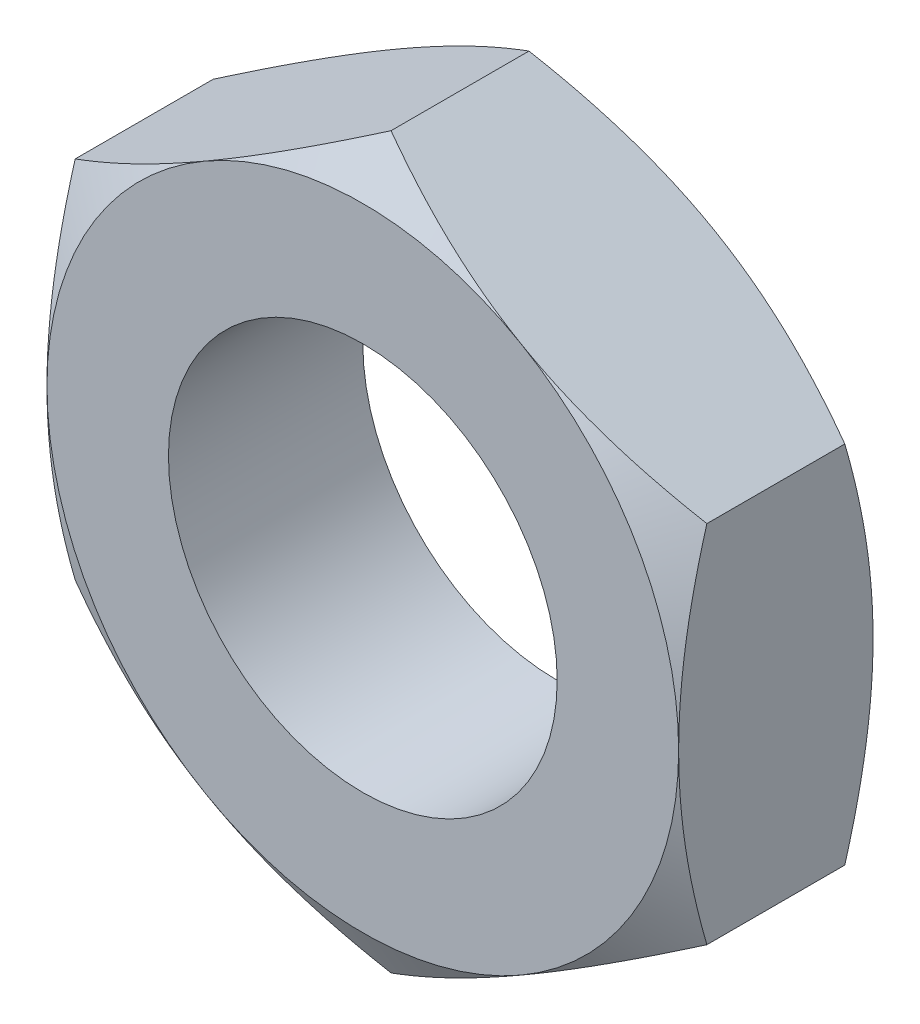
ISO-10303-21;
HEADER;
FILE_DESCRIPTION(('STEP AP214'),'2;1');
FILE_NAME('part.step','',(''),(''),'','','');
FILE_SCHEMA(('AUTOMOTIVE_DESIGN { 1 0 10303 214 1 1 1 1 }'));
ENDSEC;
DATA;
#1=APPLICATION_CONTEXT('core data for automotive mechanical design processes');
#2=APPLICATION_PROTOCOL_DEFINITION('international standard','automotive_design',2000,#1);
#3=PRODUCT_CONTEXT('',#1,'mechanical');
#4=PRODUCT('Part','Part','',(#3));
#5=PRODUCT_RELATED_PRODUCT_CATEGORY('part','',(#4));
#6=PRODUCT_DEFINITION_FORMATION('','',#4);
#7=PRODUCT_DEFINITION_CONTEXT('part definition',#1,'design');
#8=PRODUCT_DEFINITION('design','',#6,#7);
#9=PRODUCT_DEFINITION_SHAPE('','',#8);
#10=(LENGTH_UNIT() NAMED_UNIT(*) SI_UNIT(.MILLI.,.METRE.));
#11=(NAMED_UNIT(*) PLANE_ANGLE_UNIT() SI_UNIT($,.RADIAN.));
#12=(NAMED_UNIT(*) SI_UNIT($,.STERADIAN.) SOLID_ANGLE_UNIT());
#13=UNCERTAINTY_MEASURE_WITH_UNIT(LENGTH_MEASURE(1.E-05),#10,'distance_accuracy_value','');
#14=(GEOMETRIC_REPRESENTATION_CONTEXT(3) GLOBAL_UNCERTAINTY_ASSIGNED_CONTEXT((#13)) GLOBAL_UNIT_ASSIGNED_CONTEXT((#10,
#11,#12)) REPRESENTATION_CONTEXT('',''));
#15=CARTESIAN_POINT('',(0.,0.,0.));
#16=DIRECTION('',(0.,0.,1.));
#17=DIRECTION('',(1.,0.,0.));
#18=AXIS2_PLACEMENT_3D('',#15,#16,#17);
#19=CARTESIAN_POINT('',(4.,0.,0.));
#20=DIRECTION('',(0.,0.,-1.));
#21=DIRECTION('',(0.,1.,0.));
#22=AXIS2_PLACEMENT_3D('',#19,#20,#21);
#23=PLANE('',#22);
#24=CARTESIAN_POINT('',(0.,0.,0.));
#25=DIRECTION('',(0.,0.,-1.));
#26=DIRECTION('',(0.,1.,0.));
#27=AXIS2_PLACEMENT_3D('',#24,#25,#26);
#28=CIRCLE('',#27,4.);
#29=CARTESIAN_POINT('',(0.,4.,0.));
#30=VERTEX_POINT('',#29);
#31=EDGE_CURVE('E109',#30,#30,#28,.T.);
#32=ORIENTED_EDGE('',*,*,#31,.F.);
#33=EDGE_LOOP('',(#32));
#34=FACE_BOUND('',#33,.T.);
#35=CARTESIAN_POINT('',(0.,0.,1.59178226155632E-11));
#36=DIRECTION('',(0.,0.,1.));
#37=DIRECTION('',(0.,-1.,0.));
#38=AXIS2_PLACEMENT_3D('',#35,#36,#37);
#39=CIRCLE('',#38,6.49999999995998);
#40=CARTESIAN_POINT('',(-3.24999999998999,5.62916512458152,2.74710809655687E-11));
#41=VERTEX_POINT('',#40);
#42=CARTESIAN_POINT('',(-6.49999999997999,0.,2.74710809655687E-11));
#43=VERTEX_POINT('',#42);
#44=EDGE_CURVE('E415',#41,#43,#39,.T.);
#45=ORIENTED_EDGE('',*,*,#44,.F.);
#46=CARTESIAN_POINT('',(0.,0.,1.59178226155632E-11));
#47=DIRECTION('',(0.,0.,1.));
#48=DIRECTION('',(0.,-1.,0.));
#49=AXIS2_PLACEMENT_3D('',#46,#47,#48);
#50=CIRCLE('',#49,6.49999999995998);
#51=CARTESIAN_POINT('',(3.24999999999,5.62916512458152,2.74710809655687E-11));
#52=VERTEX_POINT('',#51);
#53=EDGE_CURVE('E104',#52,#41,#50,.T.);
#54=ORIENTED_EDGE('',*,*,#53,.F.);
#55=CARTESIAN_POINT('',(0.,0.,1.59178226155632E-11));
#56=DIRECTION('',(0.,0.,1.));
#57=DIRECTION('',(0.,-1.,0.));
#58=AXIS2_PLACEMENT_3D('',#55,#56,#57);
#59=CIRCLE('',#58,6.49999999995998);
#60=CARTESIAN_POINT('',(6.49999999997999,0.,2.74710809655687E-11));
#61=VERTEX_POINT('',#60);
#62=EDGE_CURVE('E17',#61,#52,#59,.T.);
#63=ORIENTED_EDGE('',*,*,#62,.F.);
#64=CARTESIAN_POINT('',(0.,0.,1.59178226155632E-11));
#65=DIRECTION('',(0.,0.,1.));
#66=DIRECTION('',(0.,-1.,0.));
#67=AXIS2_PLACEMENT_3D('',#64,#65,#66);
#68=CIRCLE('',#67,6.49999999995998);
#69=CARTESIAN_POINT('',(3.24999999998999,-5.62916512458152,2.74710809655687E-11));
#70=VERTEX_POINT('',#69);
#71=EDGE_CURVE('E101',#70,#61,#68,.T.);
#72=ORIENTED_EDGE('',*,*,#71,.F.);
#73=CARTESIAN_POINT('',(0.,0.,1.59178226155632E-11));
#74=DIRECTION('',(0.,0.,1.));
#75=DIRECTION('',(0.,-1.,0.));
#76=AXIS2_PLACEMENT_3D('',#73,#74,#75);
#77=CIRCLE('',#76,6.49999999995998);
#78=CARTESIAN_POINT('',(-3.24999999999,-5.62916512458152,2.74710809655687E-11));
#79=VERTEX_POINT('',#78);
#80=EDGE_CURVE('E119',#79,#70,#77,.T.);
#81=ORIENTED_EDGE('',*,*,#80,.F.);
#82=CARTESIAN_POINT('',(0.,0.,1.59178226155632E-11));
#83=DIRECTION('',(0.,0.,1.));
#84=DIRECTION('',(0.,-1.,0.));
#85=AXIS2_PLACEMENT_3D('',#82,#83,#84);
#86=CIRCLE('',#85,6.49999999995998);
#87=EDGE_CURVE('E417',#43,#79,#86,.T.);
#88=ORIENTED_EDGE('',*,*,#87,.F.);
#89=EDGE_LOOP('',(#45,#54,#63,#72,#81,#88));
#90=FACE_BOUND('',#89,.T.);
#91=ADVANCED_FACE('F14',(#34,#90),#23,.T.);
#92=CARTESIAN_POINT('',(0.,0.,0.584039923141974));
#93=DIRECTION('',(0.,0.,1.));
#94=DIRECTION('',(0.,-1.,0.));
#95=AXIS2_PLACEMENT_3D('',#92,#93,#94);
#96=CONICAL_SURFACE('',#95,7.51158682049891,1.047197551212);
#97=CARTESIAN_POINT('',(6.49999999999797,3.75277674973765,0.580556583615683));
#98=CARTESIAN_POINT('',(6.2354513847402,3.90551396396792,0.492351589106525));
#99=CARTESIAN_POINT('',(5.96878416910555,4.05947435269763,0.411540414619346));
#100=CARTESIAN_POINT('',(5.43309909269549,4.36875227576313,0.26903136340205));
#101=CARTESIAN_POINT('',(5.16409991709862,4.52405902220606,0.207238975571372));
#102=CARTESIAN_POINT('',(4.75806245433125,4.75848486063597,0.131368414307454));
#103=CARTESIAN_POINT('',(4.622203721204,4.83692293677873,0.108872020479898));
#104=CARTESIAN_POINT('',(4.34983584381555,4.99417460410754,0.0699302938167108));
#105=CARTESIAN_POINT('',(4.21332671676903,5.07298818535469,0.0534848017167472));
#106=CARTESIAN_POINT('',(3.9391531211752,5.23128238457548,0.0269338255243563));
#107=CARTESIAN_POINT('',(3.80148629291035,5.31076436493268,0.0168605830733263));
#108=CARTESIAN_POINT('',(3.52588189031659,5.46988464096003,0.00337972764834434));
#109=CARTESIAN_POINT('',(3.38794426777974,5.54952296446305,-2.65652187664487E-05));
#110=CARTESIAN_POINT('',(3.24999999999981,5.62916512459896,3.90243393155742E-11));
#111=B_SPLINE_CURVE_WITH_KNOTS('',3,(#97,#98,#99,#100,#101,#102,#103,#104,#105,#106,#107,#108,
#109,#110),.UNSPECIFIED.,.F.,.F.,(4,2,2,2,2,2,4),(0.,0.954247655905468,1.90367376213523,
2.37900973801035,2.85433320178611,3.33204281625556,3.80984701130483),.UNSPECIFIED.);
#112=CARTESIAN_POINT('',(6.49999999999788,3.75277674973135,0.580556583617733));
#113=VERTEX_POINT('',#112);
#114=EDGE_CURVE('E124',#113,#52,#111,.T.);
#115=ORIENTED_EDGE('',*,*,#114,.F.);
#116=CARTESIAN_POINT('',(6.50000000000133,0.,3.82541220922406E-11));
#117=CARTESIAN_POINT('',(6.50000000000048,0.159284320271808,-2.65652190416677E-05));
#118=CARTESIAN_POINT('',(6.50000000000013,0.318560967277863,0.00337972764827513));
#119=CARTESIAN_POINT('',(6.49999999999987,0.636801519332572,0.0168605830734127));
#120=CARTESIAN_POINT('',(6.49999999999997,0.795765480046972,0.0269338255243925));
#121=CARTESIAN_POINT('',(6.50000000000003,1.11235387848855,0.0534848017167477));
#122=CARTESIAN_POINT('',(6.50000000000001,1.26998104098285,0.0699302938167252));
#123=CARTESIAN_POINT('',(6.49999999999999,1.58448437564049,0.108872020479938));
#124=CARTESIAN_POINT('',(6.5,1.74136052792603,0.131368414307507));
#125=CARTESIAN_POINT('',(6.50000000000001,2.21021220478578,0.207238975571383));
#126=CARTESIAN_POINT('',(6.5,2.52082569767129,0.269031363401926));
#127=CARTESIAN_POINT('',(6.5,3.13938154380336,0.411540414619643));
#128=CARTESIAN_POINT('',(6.49999999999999,3.44730232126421,0.492351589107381));
#129=CARTESIAN_POINT('',(6.5,3.75277674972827,0.580556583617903));
#130=B_SPLINE_CURVE_WITH_KNOTS('',3,(#116,#117,#118,#119,#120,#121,#122,#123,#124,#125,#126,
#127,#128,#129),.UNSPECIFIED.,.F.,.F.,(4,2,2,2,2,2,4),(0.,0.477804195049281,0.955513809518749,
1.43083727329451,1.90617324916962,2.85559935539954,3.80984701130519),.UNSPECIFIED.);
#131=EDGE_CURVE('E121',#61,#113,#130,.T.);
#132=ORIENTED_EDGE('',*,*,#131,.F.);
#133=ORIENTED_EDGE('',*,*,#62,.T.);
#134=EDGE_LOOP('',(#115,#132,#133));
#135=FACE_BOUND('',#134,.T.);
#136=ADVANCED_FACE('F122',(#135),#96,.T.);
#137=CARTESIAN_POINT('',(0.,0.,0.584039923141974));
#138=DIRECTION('',(0.,0.,1.));
#139=DIRECTION('',(0.,-1.,0.));
#140=AXIS2_PLACEMENT_3D('',#137,#138,#139);
#141=CONICAL_SURFACE('',#140,7.51158682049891,1.047197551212);
#142=CARTESIAN_POINT('',(-5.41299321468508E-12,7.50555349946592,0.580556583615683));
#143=CARTESIAN_POINT('',(-0.264548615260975,7.35281628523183,0.492351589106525));
#144=CARTESIAN_POINT('',(-0.531215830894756,7.19885589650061,0.411540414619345));
#145=CARTESIAN_POINT('',(-1.06690090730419,6.88957797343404,0.269031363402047));
#146=CARTESIAN_POINT('',(-1.33590008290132,6.73427122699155,0.207238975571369));
#147=CARTESIAN_POINT('',(-1.74193754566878,6.49984538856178,0.131368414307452));
#148=CARTESIAN_POINT('',(-1.87779627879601,6.42140731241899,0.108872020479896));
#149=CARTESIAN_POINT('',(-2.15016415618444,6.26415564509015,0.069930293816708));
#150=CARTESIAN_POINT('',(-2.28667328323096,6.18534206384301,0.0534848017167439));
#151=CARTESIAN_POINT('',(-2.5608468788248,6.02704786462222,0.0269338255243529));
#152=CARTESIAN_POINT('',(-2.69851370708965,5.94756588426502,0.0168605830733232));
#153=CARTESIAN_POINT('',(-2.97411810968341,5.78844560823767,0.00337972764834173));
#154=CARTESIAN_POINT('',(-3.11205573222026,5.70880728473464,-2.65652187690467E-05));
#155=CARTESIAN_POINT('',(-3.25000000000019,5.62916512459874,3.90208698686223E-11));
#156=B_SPLINE_CURVE_WITH_KNOTS('',3,(#142,#143,#144,#145,#146,#147,#148,#149,#150,#151,#152,
#153,#154,#155),.UNSPECIFIED.,.F.,.F.,(4,2,2,2,2,2,4),(0.,0.954247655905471,1.90367376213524,
2.37900973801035,2.85433320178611,3.33204281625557,3.80984701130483),.UNSPECIFIED.);
#157=CARTESIAN_POINT('',(0.,7.50555349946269,0.580556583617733));
#158=VERTEX_POINT('',#157);
#159=EDGE_CURVE('E294',#158,#41,#156,.T.);
#160=ORIENTED_EDGE('',*,*,#159,.F.);
#161=CARTESIAN_POINT('',(3.25000000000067,5.62916512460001,3.82541220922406E-11));
#162=CARTESIAN_POINT('',(3.11205573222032,5.70880728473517,-2.65652190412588E-05));
#163=CARTESIAN_POINT('',(2.97411810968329,5.7884456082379,0.00337972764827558));
#164=CARTESIAN_POINT('',(2.6985137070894,5.94756588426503,0.016860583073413));
#165=CARTESIAN_POINT('',(2.56084687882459,6.02704786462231,0.0269338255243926));
#166=CARTESIAN_POINT('',(2.28667328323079,6.18534206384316,0.0534848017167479));
#167=CARTESIAN_POINT('',(2.15016415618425,6.26415564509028,0.0699302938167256));
#168=CARTESIAN_POINT('',(1.87779627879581,6.42140731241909,0.108872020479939));
#169=CARTESIAN_POINT('',(1.74193754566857,6.49984538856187,0.131368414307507));
#170=CARTESIAN_POINT('',(1.33590008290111,6.73427122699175,0.207238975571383));
#171=CARTESIAN_POINT('',(1.06690090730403,6.8895779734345,0.269031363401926));
#172=CARTESIAN_POINT('',(0.531215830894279,7.19885589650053,0.411540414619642));
#173=CARTESIAN_POINT('',(0.26454861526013,7.35281628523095,0.49235158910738));
#174=CARTESIAN_POINT('',(3.72325430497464E-12,7.50555349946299,0.580556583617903));
#175=B_SPLINE_CURVE_WITH_KNOTS('',3,(#161,#162,#163,#164,#165,#166,#167,#168,#169,#170,#171,
#172,#173,#174),.UNSPECIFIED.,.F.,.F.,(4,2,2,2,2,2,4),(0.,0.477804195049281,0.955513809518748,
1.43083727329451,1.90617324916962,2.85559935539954,3.80984701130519),.UNSPECIFIED.);
#176=EDGE_CURVE('E302',#52,#158,#175,.T.);
#177=ORIENTED_EDGE('',*,*,#176,.F.);
#178=ORIENTED_EDGE('',*,*,#53,.T.);
#179=EDGE_LOOP('',(#160,#177,#178));
#180=FACE_BOUND('',#179,.T.);
#181=ADVANCED_FACE('F283',(#180),#141,.T.);
#182=CARTESIAN_POINT('',(0.,0.,0.584039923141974));
#183=DIRECTION('',(0.,0.,1.));
#184=DIRECTION('',(0.,-1.,0.));
#185=AXIS2_PLACEMENT_3D('',#182,#183,#184);
#186=CONICAL_SURFACE('',#185,7.51158682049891,1.047197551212);
#187=CARTESIAN_POINT('',(-6.50000000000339,3.75277674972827,0.580556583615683));
#188=CARTESIAN_POINT('',(-6.50000000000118,3.44730232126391,0.492351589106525));
#189=CARTESIAN_POINT('',(-6.50000000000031,3.13938154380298,0.411540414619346));
#190=CARTESIAN_POINT('',(-6.49999999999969,2.52082569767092,0.269031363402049));
#191=CARTESIAN_POINT('',(-6.49999999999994,2.21021220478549,0.207238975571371));
#192=CARTESIAN_POINT('',(-6.50000000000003,1.74136052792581,0.131368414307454));
#193=CARTESIAN_POINT('',(-6.50000000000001,1.58448437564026,0.108872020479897));
#194=CARTESIAN_POINT('',(-6.49999999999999,1.26998104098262,0.0699302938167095));
#195=CARTESIAN_POINT('',(-6.5,1.11235387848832,0.053484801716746));
#196=CARTESIAN_POINT('',(-6.5,0.795765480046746,0.0269338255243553));
#197=CARTESIAN_POINT('',(-6.5,0.636801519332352,0.0168605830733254));
#198=CARTESIAN_POINT('',(-6.5,0.318560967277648,0.003379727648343));
#199=CARTESIAN_POINT('',(-6.5,0.159284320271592,-2.65652187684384E-05));
#200=CARTESIAN_POINT('',(-6.5,-2.22069117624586E-13,3.90208698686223E-11));
#201=B_SPLINE_CURVE_WITH_KNOTS('',3,(#187,#188,#189,#190,#191,#192,#193,#194,#195,#196,#197,
#198,#199,#200),.UNSPECIFIED.,.F.,.F.,(4,2,2,2,2,2,4),(0.,0.954247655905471,1.90367376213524,
2.37900973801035,2.85433320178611,3.33204281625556,3.80984701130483),.UNSPECIFIED.);
#202=CARTESIAN_POINT('',(-6.49999999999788,3.75277674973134,0.580556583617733));
#203=VERTEX_POINT('',#202);
#204=EDGE_CURVE('E262',#203,#43,#201,.T.);
#205=ORIENTED_EDGE('',*,*,#204,.F.);
#206=CARTESIAN_POINT('',(-3.25000000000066,5.6291651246,3.82506526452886E-11));
#207=CARTESIAN_POINT('',(-3.38794426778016,5.54952296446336,-2.65652190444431E-05));
#208=CARTESIAN_POINT('',(-3.52588189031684,5.46988464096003,0.0033797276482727));
#209=CARTESIAN_POINT('',(-3.80148629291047,5.31076436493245,0.0168605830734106));
#210=CARTESIAN_POINT('',(-3.93915312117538,5.23128238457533,0.0269338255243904));
#211=CARTESIAN_POINT('',(-4.21332671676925,5.0729881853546,0.0534848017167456));
#212=CARTESIAN_POINT('',(-4.34983584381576,4.99417460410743,0.0699302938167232));
#213=CARTESIAN_POINT('',(-4.62220372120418,4.8369229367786,0.108872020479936));
#214=CARTESIAN_POINT('',(-4.75806245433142,4.75848486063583,0.131368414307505));
#215=CARTESIAN_POINT('',(-5.1640999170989,4.52405902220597,0.207238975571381));
#216=CARTESIAN_POINT('',(-5.43309909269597,4.36875227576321,0.269031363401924));
#217=CARTESIAN_POINT('',(-5.96878416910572,4.05947435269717,0.411540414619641));
#218=CARTESIAN_POINT('',(-6.23545138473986,3.90551396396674,0.492351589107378));
#219=CARTESIAN_POINT('',(-6.49999999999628,3.75277674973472,0.5805565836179));
#220=B_SPLINE_CURVE_WITH_KNOTS('',3,(#206,#207,#208,#209,#210,#211,#212,#213,#214,#215,#216,
#217,#218,#219),.UNSPECIFIED.,.F.,.F.,(4,2,2,2,2,2,4),(0.,0.477804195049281,0.955513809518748,
1.43083727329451,1.90617324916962,2.85559935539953,3.80984701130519),.UNSPECIFIED.);
#221=EDGE_CURVE('E287',#41,#203,#220,.T.);
#222=ORIENTED_EDGE('',*,*,#221,.F.);
#223=ORIENTED_EDGE('',*,*,#44,.T.);
#224=EDGE_LOOP('',(#205,#222,#223));
#225=FACE_BOUND('',#224,.T.);
#226=ADVANCED_FACE('F277',(#225),#186,.T.);
#227=CARTESIAN_POINT('',(0.,0.,0.584039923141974));
#228=DIRECTION('',(0.,0.,1.));
#229=DIRECTION('',(0.,-1.,0.));
#230=AXIS2_PLACEMENT_3D('',#227,#228,#229);
#231=CONICAL_SURFACE('',#230,7.51158682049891,1.047197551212);
#232=CARTESIAN_POINT('',(-6.50000000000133,0.,3.82541220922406E-11));
#233=CARTESIAN_POINT('',(-6.50000000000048,-0.159284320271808,-2.65652190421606E-05));
#234=CARTESIAN_POINT('',(-6.50000000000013,-0.318560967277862,0.00337972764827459));
#235=CARTESIAN_POINT('',(-6.49999999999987,-0.636801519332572,0.0168605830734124));
#236=CARTESIAN_POINT('',(-6.49999999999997,-0.795765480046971,0.0269338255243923));
#237=CARTESIAN_POINT('',(-6.50000000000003,-1.11235387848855,0.0534848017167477));
#238=CARTESIAN_POINT('',(-6.50000000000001,-1.26998104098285,0.0699302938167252));
#239=CARTESIAN_POINT('',(-6.49999999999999,-1.58448437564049,0.108872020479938));
#240=CARTESIAN_POINT('',(-6.5,-1.74136052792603,0.131368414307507));
#241=CARTESIAN_POINT('',(-6.50000000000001,-2.21021220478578,0.207238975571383));
#242=CARTESIAN_POINT('',(-6.5,-2.52082569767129,0.269031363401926));
#243=CARTESIAN_POINT('',(-6.5,-3.13938154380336,0.411540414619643));
#244=CARTESIAN_POINT('',(-6.49999999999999,-3.44730232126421,0.492351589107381));
#245=CARTESIAN_POINT('',(-6.5,-3.75277674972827,0.580556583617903));
#246=B_SPLINE_CURVE_WITH_KNOTS('',3,(#232,#233,#234,#235,#236,#237,#238,#239,#240,#241,#242,
#243,#244,#245),.UNSPECIFIED.,.F.,.F.,(4,2,2,2,2,2,4),(0.,0.477804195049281,0.955513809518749,
1.43083727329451,1.90617324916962,2.85559935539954,3.80984701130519),.UNSPECIFIED.);
#247=CARTESIAN_POINT('',(-6.49999999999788,-3.75277674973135,0.580556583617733));
#248=VERTEX_POINT('',#247);
#249=EDGE_CURVE('E255',#43,#248,#246,.T.);
#250=ORIENTED_EDGE('',*,*,#249,.F.);
#251=ORIENTED_EDGE('',*,*,#87,.T.);
#252=CARTESIAN_POINT('',(-6.49999999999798,-3.75277674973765,0.580556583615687));
#253=CARTESIAN_POINT('',(-6.23545138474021,-3.90551396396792,0.492351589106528));
#254=CARTESIAN_POINT('',(-5.96878416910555,-4.05947435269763,0.411540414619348));
#255=CARTESIAN_POINT('',(-5.4330990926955,-4.36875227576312,0.26903136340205));
#256=CARTESIAN_POINT('',(-5.16409991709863,-4.52405902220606,0.207238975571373));
#257=CARTESIAN_POINT('',(-4.75806245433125,-4.75848486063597,0.131368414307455));
#258=CARTESIAN_POINT('',(-4.622203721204,-4.83692293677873,0.108872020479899));
#259=CARTESIAN_POINT('',(-4.34983584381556,-4.99417460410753,0.0699302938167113));
#260=CARTESIAN_POINT('',(-4.21332671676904,-5.07298818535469,0.0534848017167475));
#261=CARTESIAN_POINT('',(-3.93915312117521,-5.23128238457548,0.0269338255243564));
#262=CARTESIAN_POINT('',(-3.80148629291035,-5.31076436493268,0.0168605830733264));
#263=CARTESIAN_POINT('',(-3.52588189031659,-5.46988464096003,0.00337972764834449));
#264=CARTESIAN_POINT('',(-3.38794426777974,-5.54952296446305,-2.65652187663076E-05));
#265=CARTESIAN_POINT('',(-3.24999999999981,-5.62916512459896,3.90243393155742E-11));
#266=B_SPLINE_CURVE_WITH_KNOTS('',3,(#252,#253,#254,#255,#256,#257,#258,#259,#260,#261,#262,
#263,#264,#265),.UNSPECIFIED.,.F.,.F.,(4,2,2,2,2,2,4),(0.,0.954247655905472,1.90367376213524,
2.37900973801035,2.85433320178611,3.33204281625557,3.80984701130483),.UNSPECIFIED.);
#267=EDGE_CURVE('E263',#248,#79,#266,.T.);
#268=ORIENTED_EDGE('',*,*,#267,.F.);
#269=EDGE_LOOP('',(#250,#251,#268));
#270=FACE_BOUND('',#269,.T.);
#271=ADVANCED_FACE('F274',(#270),#231,.T.);
#272=CARTESIAN_POINT('',(0.,0.,0.584039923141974));
#273=DIRECTION('',(0.,0.,1.));
#274=DIRECTION('',(0.,-1.,0.));
#275=AXIS2_PLACEMENT_3D('',#272,#273,#274);
#276=CONICAL_SURFACE('',#275,7.51158682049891,1.047197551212);
#277=CARTESIAN_POINT('',(5.41299321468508E-12,-7.50555349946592,0.580556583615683));
#278=CARTESIAN_POINT('',(0.264548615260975,-7.35281628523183,0.492351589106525));
#279=CARTESIAN_POINT('',(0.531215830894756,-7.19885589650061,0.411540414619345));
#280=CARTESIAN_POINT('',(1.06690090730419,-6.88957797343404,0.269031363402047));
#281=CARTESIAN_POINT('',(1.33590008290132,-6.73427122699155,0.207238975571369));
#282=CARTESIAN_POINT('',(1.74193754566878,-6.49984538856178,0.131368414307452));
#283=CARTESIAN_POINT('',(1.87779627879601,-6.42140731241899,0.108872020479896));
#284=CARTESIAN_POINT('',(2.15016415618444,-6.26415564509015,0.069930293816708));
#285=CARTESIAN_POINT('',(2.28667328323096,-6.18534206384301,0.0534848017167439));
#286=CARTESIAN_POINT('',(2.5608468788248,-6.02704786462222,0.0269338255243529));
#287=CARTESIAN_POINT('',(2.69851370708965,-5.94756588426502,0.0168605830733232));
#288=CARTESIAN_POINT('',(2.97411810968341,-5.78844560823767,0.00337972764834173));
#289=CARTESIAN_POINT('',(3.11205573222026,-5.70880728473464,-2.65652187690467E-05));
#290=CARTESIAN_POINT('',(3.25000000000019,-5.62916512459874,3.90208698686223E-11));
#291=B_SPLINE_CURVE_WITH_KNOTS('',3,(#277,#278,#279,#280,#281,#282,#283,#284,#285,#286,#287,
#288,#289,#290),.UNSPECIFIED.,.F.,.F.,(4,2,2,2,2,2,4),(0.,0.954247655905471,1.90367376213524,
2.37900973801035,2.85433320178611,3.33204281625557,3.80984701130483),.UNSPECIFIED.);
#292=CARTESIAN_POINT('',(0.,-7.50555349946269,0.580556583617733));
#293=VERTEX_POINT('',#292);
#294=EDGE_CURVE('E163',#293,#70,#291,.T.);
#295=ORIENTED_EDGE('',*,*,#294,.F.);
#296=CARTESIAN_POINT('',(-3.25000000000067,-5.62916512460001,3.82541220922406E-11));
#297=CARTESIAN_POINT('',(-3.11205573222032,-5.70880728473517,-2.65652190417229E-05));
#298=CARTESIAN_POINT('',(-2.97411810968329,-5.7884456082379,0.00337972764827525));
#299=CARTESIAN_POINT('',(-2.6985137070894,-5.94756588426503,0.0168605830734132));
#300=CARTESIAN_POINT('',(-2.56084687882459,-6.02704786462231,0.0269338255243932));
#301=CARTESIAN_POINT('',(-2.28667328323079,-6.18534206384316,0.0534848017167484));
#302=CARTESIAN_POINT('',(-2.15016415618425,-6.26415564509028,0.0699302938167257));
#303=CARTESIAN_POINT('',(-1.87779627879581,-6.42140731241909,0.108872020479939));
#304=CARTESIAN_POINT('',(-1.74193754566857,-6.49984538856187,0.131368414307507));
#305=CARTESIAN_POINT('',(-1.33590008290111,-6.73427122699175,0.207238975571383));
#306=CARTESIAN_POINT('',(-1.06690090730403,-6.8895779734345,0.269031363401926));
#307=CARTESIAN_POINT('',(-0.531215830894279,-7.19885589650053,0.411540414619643));
#308=CARTESIAN_POINT('',(-0.264548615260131,-7.35281628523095,0.49235158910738));
#309=CARTESIAN_POINT('',(-3.72387259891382E-12,-7.50555349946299,0.580556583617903));
#310=B_SPLINE_CURVE_WITH_KNOTS('',3,(#296,#297,#298,#299,#300,#301,#302,#303,#304,#305,#306,
#307,#308,#309),.UNSPECIFIED.,.F.,.F.,(4,2,2,2,2,2,4),(0.,0.47780419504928,0.955513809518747,
1.43083727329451,1.90617324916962,2.85559935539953,3.80984701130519),.UNSPECIFIED.);
#311=EDGE_CURVE('E368',#79,#293,#310,.T.);
#312=ORIENTED_EDGE('',*,*,#311,.F.);
#313=ORIENTED_EDGE('',*,*,#80,.T.);
#314=EDGE_LOOP('',(#295,#312,#313));
#315=FACE_BOUND('',#314,.T.);
#316=ADVANCED_FACE('F150',(#315),#276,.T.);
#317=CARTESIAN_POINT('',(0.,0.,0.584039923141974));
#318=DIRECTION('',(0.,0.,1.));
#319=DIRECTION('',(0.,-1.,0.));
#320=AXIS2_PLACEMENT_3D('',#317,#318,#319);
#321=CONICAL_SURFACE('',#320,7.51158682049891,1.047197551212);
#322=CARTESIAN_POINT('',(6.50000000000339,-3.75277674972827,0.580556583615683));
#323=CARTESIAN_POINT('',(6.50000000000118,-3.44730232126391,0.492351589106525));
#324=CARTESIAN_POINT('',(6.50000000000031,-3.13938154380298,0.411540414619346));
#325=CARTESIAN_POINT('',(6.49999999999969,-2.52082569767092,0.269031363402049));
#326=CARTESIAN_POINT('',(6.49999999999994,-2.21021220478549,0.207238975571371));
#327=CARTESIAN_POINT('',(6.50000000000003,-1.74136052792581,0.131368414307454));
#328=CARTESIAN_POINT('',(6.50000000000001,-1.58448437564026,0.108872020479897));
#329=CARTESIAN_POINT('',(6.49999999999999,-1.26998104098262,0.0699302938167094));
#330=CARTESIAN_POINT('',(6.5,-1.11235387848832,0.0534848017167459));
#331=CARTESIAN_POINT('',(6.5,-0.795765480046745,0.0269338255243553));
#332=CARTESIAN_POINT('',(6.5,-0.636801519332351,0.0168605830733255));
#333=CARTESIAN_POINT('',(6.5,-0.318560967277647,0.00337972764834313));
#334=CARTESIAN_POINT('',(6.5,-0.159284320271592,-2.65652187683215E-05));
#335=CARTESIAN_POINT('',(6.5,2.22475640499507E-13,3.90208698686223E-11));
#336=B_SPLINE_CURVE_WITH_KNOTS('',3,(#322,#323,#324,#325,#326,#327,#328,#329,#330,#331,#332,
#333,#334,#335),.UNSPECIFIED.,.F.,.F.,(4,2,2,2,2,2,4),(0.,0.954247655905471,1.90367376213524,
2.37900973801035,2.85433320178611,3.33204281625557,3.80984701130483),.UNSPECIFIED.);
#337=CARTESIAN_POINT('',(6.5,-3.75277674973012,0.580556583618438));
#338=VERTEX_POINT('',#337);
#339=EDGE_CURVE('E114',#338,#61,#336,.T.);
#340=ORIENTED_EDGE('',*,*,#339,.F.);
#341=CARTESIAN_POINT('',(3.25000000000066,-5.6291651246,3.82506526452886E-11));
#342=CARTESIAN_POINT('',(3.38794426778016,-5.54952296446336,-2.65652190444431E-05));
#343=CARTESIAN_POINT('',(3.52588189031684,-5.46988464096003,0.0033797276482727));
#344=CARTESIAN_POINT('',(3.80148629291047,-5.31076436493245,0.0168605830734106));
#345=CARTESIAN_POINT('',(3.93915312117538,-5.23128238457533,0.0269338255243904));
#346=CARTESIAN_POINT('',(4.21332671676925,-5.0729881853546,0.0534848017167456));
#347=CARTESIAN_POINT('',(4.34983584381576,-4.99417460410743,0.0699302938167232));
#348=CARTESIAN_POINT('',(4.62220372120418,-4.8369229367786,0.108872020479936));
#349=CARTESIAN_POINT('',(4.75806245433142,-4.75848486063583,0.131368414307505));
#350=CARTESIAN_POINT('',(5.1640999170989,-4.52405902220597,0.207238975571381));
#351=CARTESIAN_POINT('',(5.43309909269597,-4.36875227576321,0.269031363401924));
#352=CARTESIAN_POINT('',(5.96878416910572,-4.05947435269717,0.411540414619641));
#353=CARTESIAN_POINT('',(6.23545138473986,-3.90551396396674,0.492351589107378));
#354=CARTESIAN_POINT('',(6.49999999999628,-3.75277674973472,0.5805565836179));
#355=B_SPLINE_CURVE_WITH_KNOTS('',3,(#341,#342,#343,#344,#345,#346,#347,#348,#349,#350,#351,
#352,#353,#354),.UNSPECIFIED.,.F.,.F.,(4,2,2,2,2,2,4),(0.,0.477804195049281,0.955513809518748,
1.43083727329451,1.90617324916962,2.85559935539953,3.80984701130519),.UNSPECIFIED.);
#356=EDGE_CURVE('E117',#70,#338,#355,.T.);
#357=ORIENTED_EDGE('',*,*,#356,.F.);
#358=ORIENTED_EDGE('',*,*,#71,.T.);
#359=EDGE_LOOP('',(#340,#357,#358));
#360=FACE_BOUND('',#359,.T.);
#361=ADVANCED_FACE('F112',(#360),#321,.T.);
#362=CARTESIAN_POINT('',(6.5,-3.75277674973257,0.));
#363=DIRECTION('',(1.,0.,0.));
#364=DIRECTION('',(0.,1.,0.));
#365=AXIS2_PLACEMENT_3D('',#362,#363,#364);
#366=PLANE('',#365);
#367=ORIENTED_EDGE('',*,*,#339,.T.);
#368=ORIENTED_EDGE('',*,*,#131,.T.);
#369=DIRECTION('',(0.,0.,1.));
#370=VECTOR('',#369,1.);
#371=CARTESIAN_POINT('',(6.5,3.75277674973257,0.));
#372=LINE('',#371,#370);
#373=CARTESIAN_POINT('',(6.50000001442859,3.75277674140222,3.4194434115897));
#374=VERTEX_POINT('',#373);
#375=EDGE_CURVE('E127',#374,#113,#372,.F.);
#376=ORIENTED_EDGE('',*,*,#375,.F.);
#377=CARTESIAN_POINT('',(6.5,0.,4.));
#378=CARTESIAN_POINT('',(6.5,0.159284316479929,4.0000265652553));
#379=CARTESIAN_POINT('',(6.5,0.318560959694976,3.99662027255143));
#380=CARTESIAN_POINT('',(6.5,0.63680150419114,3.98313941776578));
#381=CARTESIAN_POINT('',(6.5,0.795765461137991,3.97306617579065));
#382=CARTESIAN_POINT('',(6.5,1.11235385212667,3.94651520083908));
#383=CARTESIAN_POINT('',(6.5,1.26998101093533,3.93006970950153));
#384=CARTESIAN_POINT('',(6.5,1.58448433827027,3.89112798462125));
#385=CARTESIAN_POINT('',(6.5,1.74136048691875,3.86863159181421));
#386=CARTESIAN_POINT('',(6.5,2.21021215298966,3.79276103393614));
#387=CARTESIAN_POINT('',(6.5,2.52082563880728,3.73096864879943));
#388=CARTESIAN_POINT('',(6.5,3.13938147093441,3.58845960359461));
#389=CARTESIAN_POINT('',(6.5,3.44730224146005,3.50764843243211));
#390=CARTESIAN_POINT('',(6.5,3.75277666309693,3.41944344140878));
#391=B_SPLINE_CURVE_WITH_KNOTS('',3,(#377,#378,#379,#380,#381,#382,#383,#384,#385,#386,#387,
#388,#389,#390),.UNSPECIFIED.,.F.,.F.,(4,2,2,2,2,2,4),(0.,0.477804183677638,0.955513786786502,
1.43083723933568,1.90617320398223,2.85559928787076,3.80984692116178),.UNSPECIFIED.);
#392=CARTESIAN_POINT('',(6.5,0.,4.));
#393=VERTEX_POINT('',#392);
#394=EDGE_CURVE('E348',#393,#374,#391,.T.);
#395=ORIENTED_EDGE('',*,*,#394,.F.);
#396=CARTESIAN_POINT('',(6.5,-3.75277678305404,3.41944340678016));
#397=CARTESIAN_POINT('',(6.5,-3.44730235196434,3.50764840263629));
#398=CARTESIAN_POINT('',(6.5,-3.13938157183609,3.58845957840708));
#399=CARTESIAN_POINT('',(6.5,-2.52082572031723,3.73096863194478));
#400=CARTESIAN_POINT('',(6.5,-2.21021222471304,3.79276102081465));
#401=CARTESIAN_POINT('',(6.5,-1.74136054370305,3.8686315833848));
#402=CARTESIAN_POINT('',(6.5,-1.58448439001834,3.8911279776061));
#403=CARTESIAN_POINT('',(6.5,-1.2699810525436,3.93006970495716));
#404=CARTESIAN_POINT('',(6.5,-1.11235388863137,3.94651519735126));
#405=CARTESIAN_POINT('',(6.5,-0.795765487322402,3.97306617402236));
#406=CARTESIAN_POINT('',(6.5,-0.636801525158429,3.983139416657));
#407=CARTESIAN_POINT('',(6.5,-0.318560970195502,3.99662027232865));
#408=CARTESIAN_POINT('',(6.5,-0.159284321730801,4.00002656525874));
#409=CARTESIAN_POINT('',(6.5,0.,4.));
#410=B_SPLINE_CURVE_WITH_KNOTS('',3,(#396,#397,#398,#399,#400,#401,#402,#403,#404,#405,#406,
#407,#408,#409),.UNSPECIFIED.,.F.,.F.,(4,2,2,2,2,2,4),(0.,0.954247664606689,1.90367377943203,
2.37900975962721,2.85433322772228,3.33204284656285,3.80984704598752),.UNSPECIFIED.);
#411=CARTESIAN_POINT('',(6.5,-3.75277676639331,3.4194434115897));
#412=VERTEX_POINT('',#411);
#413=EDGE_CURVE('E354',#412,#393,#410,.T.);
#414=ORIENTED_EDGE('',*,*,#413,.F.);
#415=DIRECTION('',(0.,0.,1.));
#416=VECTOR('',#415,1.);
#417=CARTESIAN_POINT('',(6.5,-3.75277674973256,0.));
#418=LINE('',#417,#416);
#419=EDGE_CURVE('E131',#338,#412,#418,.T.);
#420=ORIENTED_EDGE('',*,*,#419,.F.);
#421=EDGE_LOOP('',(#367,#368,#376,#395,#414,#420));
#422=FACE_BOUND('',#421,.T.);
#423=ADVANCED_FACE('F129',(#422),#366,.T.);
#424=CARTESIAN_POINT('',(6.5,3.75277674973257,0.));
#425=DIRECTION('',(0.5,0.866025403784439,0.));
#426=DIRECTION('',(-0.866025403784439,0.5,0.));
#427=AXIS2_PLACEMENT_3D('',#424,#425,#426);
#428=PLANE('',#427);
#429=ORIENTED_EDGE('',*,*,#114,.T.);
#430=ORIENTED_EDGE('',*,*,#176,.T.);
#431=DIRECTION('',(0.,0.,1.));
#432=VECTOR('',#431,1.);
#433=CARTESIAN_POINT('',(0.,7.50555349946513,0.));
#434=LINE('',#433,#432);
#435=CARTESIAN_POINT('',(-1.15428969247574E-08,7.50555349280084,3.41944342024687));
#436=VERTEX_POINT('',#435);
#437=EDGE_CURVE('E301',#436,#158,#434,.F.);
#438=ORIENTED_EDGE('',*,*,#437,.F.);
#439=CARTESIAN_POINT('',(3.25,5.62916512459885,4.));
#440=CARTESIAN_POINT('',(3.11205573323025,5.70880728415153,4.00002656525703));
#441=CARTESIAN_POINT('',(2.97411811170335,5.78844560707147,3.99662027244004));
#442=CARTESIAN_POINT('',(2.69851371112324,5.94756588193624,3.98313941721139));
#443=CARTESIAN_POINT('',(2.5608468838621,6.02704786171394,3.97306617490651));
#444=CARTESIAN_POINT('',(2.28667329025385,6.18534205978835,3.94651519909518));
#445=CARTESIAN_POINT('',(2.15016416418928,6.26415564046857,3.93006970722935));
#446=CARTESIAN_POINT('',(1.87779628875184,6.42140730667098,3.89112798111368));
#447=CARTESIAN_POINT('',(1.74193755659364,6.49984538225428,3.86863158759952));
#448=CARTESIAN_POINT('',(1.33590009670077,6.7342712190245,3.79276102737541));
#449=CARTESIAN_POINT('',(1.06690092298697,6.88957796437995,3.73096864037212));
#450=CARTESIAN_POINT('',(0.531215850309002,7.19885588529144,3.58845959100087));
#451=CARTESIAN_POINT('',(0.264548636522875,7.35281627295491,3.50764841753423));
#452=CARTESIAN_POINT('',(2.30857966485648E-08,7.50555348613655,3.4194434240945));
#453=B_SPLINE_CURVE_WITH_KNOTS('',3,(#439,#440,#441,#442,#443,#444,#445,#446,#447,#448,#449,
#450,#451,#452),.UNSPECIFIED.,.F.,.F.,(4,2,2,2,2,2,4),(0.,0.477804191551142,0.95551380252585,
1.43083726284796,1.90617323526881,2.85559933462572,3.80984698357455),.UNSPECIFIED.);
#454=CARTESIAN_POINT('',(3.25,5.62916512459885,4.));
#455=VERTEX_POINT('',#454);
#456=EDGE_CURVE('E326',#455,#436,#453,.T.);
#457=ORIENTED_EDGE('',*,*,#456,.F.);
#458=CARTESIAN_POINT('',(6.50000002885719,3.75277673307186,3.41944340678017));
#459=CARTESIAN_POINT('',(6.23545141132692,3.90551394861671,3.50764840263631));
#460=CARTESIAN_POINT('',(5.96878419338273,4.05947433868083,3.58845957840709));
#461=CARTESIAN_POINT('',(5.43309911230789,4.36875226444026,3.73096863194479));
#462=CARTESIAN_POINT('',(5.16409993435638,4.52405901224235,3.79276102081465));
#463=CARTESIAN_POINT('',(4.7580624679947,4.75848485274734,3.86863158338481));
#464=CARTESIAN_POINT('',(4.62220373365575,4.8369229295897,3.8911279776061));
#465=CARTESIAN_POINT('',(4.34983585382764,4.99417459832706,3.93006970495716));
#466=CARTESIAN_POINT('',(4.21332672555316,5.07298818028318,3.94651519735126));
#467=CARTESIAN_POINT('',(3.93915312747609,5.23128238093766,3.97306617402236));
#468=CARTESIAN_POINT('',(3.80148629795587,5.31076436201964,3.983139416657));
#469=CARTESIAN_POINT('',(3.52588189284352,5.4698846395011,3.99662027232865));
#470=CARTESIAN_POINT('',(3.38794426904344,5.54952296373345,4.00002656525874));
#471=CARTESIAN_POINT('',(3.25,5.62916512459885,4.));
#472=B_SPLINE_CURVE_WITH_KNOTS('',3,(#458,#459,#460,#461,#462,#463,#464,#465,#466,#467,#468,
#469,#470,#471),.UNSPECIFIED.,.F.,.F.,(4,2,2,2,2,2,4),(0.,0.954247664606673,1.903673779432,
2.37900975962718,2.85433322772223,3.3320428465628,3.80984704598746),.UNSPECIFIED.);
#473=EDGE_CURVE('E318',#374,#455,#472,.T.);
#474=ORIENTED_EDGE('',*,*,#473,.F.);
#475=ORIENTED_EDGE('',*,*,#375,.T.);
#476=EDGE_LOOP('',(#429,#430,#438,#457,#474,#475));
#477=FACE_BOUND('',#476,.T.);
#478=ADVANCED_FACE('F311',(#477),#428,.T.);
#479=CARTESIAN_POINT('',(0.,7.50555349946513,0.));
#480=DIRECTION('',(-0.5,0.866025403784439,0.));
#481=DIRECTION('',(-0.866025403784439,-0.5,0.));
#482=AXIS2_PLACEMENT_3D('',#479,#480,#481);
#483=PLANE('',#482);
#484=ORIENTED_EDGE('',*,*,#159,.T.);
#485=ORIENTED_EDGE('',*,*,#221,.T.);
#486=DIRECTION('',(0.,0.,1.));
#487=VECTOR('',#486,1.);
#488=CARTESIAN_POINT('',(-6.5,3.75277674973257,0.));
#489=LINE('',#488,#487);
#490=CARTESIAN_POINT('',(-6.5,3.75277676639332,3.41944341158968));
#491=VERTEX_POINT('',#490);
#492=EDGE_CURVE('E293',#491,#203,#489,.F.);
#493=ORIENTED_EDGE('',*,*,#492,.F.);
#494=CARTESIAN_POINT('',(-3.25,5.62916512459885,4.));
#495=CARTESIAN_POINT('',(-3.38794426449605,5.54952296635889,4.00002656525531));
#496=CARTESIAN_POINT('',(-3.52588188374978,5.46988464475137,3.99662027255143));
#497=CARTESIAN_POINT('',(-3.80148627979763,5.3107643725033,3.98313941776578));
#498=CARTESIAN_POINT('',(-3.93915310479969,5.23128239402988,3.97306617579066));
#499=CARTESIAN_POINT('',(-4.2133266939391,5.07298819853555,3.94651520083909));
#500=CARTESIAN_POINT('',(-4.34983581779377,4.99417461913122,3.93006970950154));
#501=CARTESIAN_POINT('',(-4.62220368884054,4.83692295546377,3.89112798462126));
#502=CARTESIAN_POINT('',(-4.75806241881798,4.75848488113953,3.86863159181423));
#503=CARTESIAN_POINT('',(-5.16409987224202,4.52405904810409,3.79276103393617));
#504=CARTESIAN_POINT('',(-5.43309904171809,4.36875230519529,3.73096864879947));
#505=CARTESIAN_POINT('',(-5.96878410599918,4.05947438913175,3.58845960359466));
#506=CARTESIAN_POINT('',(-6.23545131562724,3.90551400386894,3.50764843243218));
#507=CARTESIAN_POINT('',(-6.49999992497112,3.75277679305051,3.41944344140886));
#508=B_SPLINE_CURVE_WITH_KNOTS('',3,(#494,#495,#496,#497,#498,#499,#500,#501,#502,#503,#504,
#505,#506,#507),.UNSPECIFIED.,.F.,.F.,(4,2,2,2,2,2,4),(0.,0.477804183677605,0.955513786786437,
1.43083723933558,1.90617320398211,2.85559928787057,3.80984692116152),.UNSPECIFIED.);
#509=CARTESIAN_POINT('',(-3.25,5.62916512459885,4.));
#510=VERTEX_POINT('',#509);
#511=EDGE_CURVE('E401',#510,#491,#508,.T.);
#512=ORIENTED_EDGE('',*,*,#511,.F.);
#513=CARTESIAN_POINT('',(-2.30857938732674E-08,7.50555348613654,3.4194434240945));
#514=CARTESIAN_POINT('',(-0.264548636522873,7.3528162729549,3.50764841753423));
#515=CARTESIAN_POINT('',(-0.531215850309,7.19885588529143,3.58845959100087));
#516=CARTESIAN_POINT('',(-1.06690092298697,6.88957796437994,3.73096864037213));
#517=CARTESIAN_POINT('',(-1.33590009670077,6.73427121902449,3.79276102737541));
#518=CARTESIAN_POINT('',(-1.74193755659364,6.49984538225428,3.86863158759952));
#519=CARTESIAN_POINT('',(-1.87779628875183,6.42140730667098,3.89112798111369));
#520=CARTESIAN_POINT('',(-2.15016416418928,6.26415564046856,3.93006970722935));
#521=CARTESIAN_POINT('',(-2.28667329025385,6.18534205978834,3.94651519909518));
#522=CARTESIAN_POINT('',(-2.56084688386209,6.02704786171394,3.97306617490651));
#523=CARTESIAN_POINT('',(-2.69851371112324,5.94756588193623,3.9831394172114));
#524=CARTESIAN_POINT('',(-2.97411811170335,5.78844560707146,3.99662027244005));
#525=CARTESIAN_POINT('',(-3.11205573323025,5.70880728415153,4.00002656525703));
#526=CARTESIAN_POINT('',(-3.25,5.62916512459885,4.));
#527=B_SPLINE_CURVE_WITH_KNOTS('',3,(#513,#514,#515,#516,#517,#518,#519,#520,#521,#522,#523,
#524,#525,#526),.UNSPECIFIED.,.F.,.F.,(4,2,2,2,2,2,4),(0.,0.954247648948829,1.90367374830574,
2.3790097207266,2.8543331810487,3.33204279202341,3.80984698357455),.UNSPECIFIED.);
#528=EDGE_CURVE('E333',#436,#510,#527,.T.);
#529=ORIENTED_EDGE('',*,*,#528,.F.);
#530=ORIENTED_EDGE('',*,*,#437,.T.);
#531=EDGE_LOOP('',(#484,#485,#493,#512,#529,#530));
#532=FACE_BOUND('',#531,.T.);
#533=ADVANCED_FACE('F247',(#532),#483,.T.);
#534=CARTESIAN_POINT('',(-6.5,3.75277674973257,0.));
#535=DIRECTION('',(-1.,0.,0.));
#536=DIRECTION('',(0.,-1.,0.));
#537=AXIS2_PLACEMENT_3D('',#534,#535,#536);
#538=PLANE('',#537);
#539=ORIENTED_EDGE('',*,*,#204,.T.);
#540=ORIENTED_EDGE('',*,*,#249,.T.);
#541=DIRECTION('',(0.,0.,1.));
#542=VECTOR('',#541,1.);
#543=CARTESIAN_POINT('',(-6.5,-3.75277674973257,0.));
#544=LINE('',#543,#542);
#545=CARTESIAN_POINT('',(-6.50000001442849,-3.75277674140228,3.41944341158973));
#546=VERTEX_POINT('',#545);
#547=EDGE_CURVE('E261',#546,#248,#544,.F.);
#548=ORIENTED_EDGE('',*,*,#547,.F.);
#549=CARTESIAN_POINT('',(-6.5,0.,4.));
#550=CARTESIAN_POINT('',(-6.5,-0.159284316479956,4.0000265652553));
#551=CARTESIAN_POINT('',(-6.5,-0.318560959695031,3.99662027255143));
#552=CARTESIAN_POINT('',(-6.5,-0.636801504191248,3.98313941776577));
#553=CARTESIAN_POINT('',(-6.5,-0.795765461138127,3.97306617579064));
#554=CARTESIAN_POINT('',(-6.5,-1.11235385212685,3.94651520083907));
#555=CARTESIAN_POINT('',(-6.5,-1.26998101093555,3.93006970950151));
#556=CARTESIAN_POINT('',(-6.5,-1.58448433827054,3.89112798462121));
#557=CARTESIAN_POINT('',(-6.5,-1.74136048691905,3.86863159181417));
#558=CARTESIAN_POINT('',(-6.5,-2.21021215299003,3.79276103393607));
#559=CARTESIAN_POINT('',(-6.5,-2.5208256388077,3.73096864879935));
#560=CARTESIAN_POINT('',(-6.5,-3.13938147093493,3.58845960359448));
#561=CARTESIAN_POINT('',(-6.5,-3.44730224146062,3.50764843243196));
#562=CARTESIAN_POINT('',(-6.5,-3.75277666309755,3.41944344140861));
#563=B_SPLINE_CURVE_WITH_KNOTS('',3,(#549,#550,#551,#552,#553,#554,#555,#556,#557,#558,#559,
#560,#561,#562),.UNSPECIFIED.,.F.,.F.,(4,2,2,2,2,2,4),(0.,0.47780418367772,0.955513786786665,
1.43083723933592,1.90617320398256,2.85559928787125,3.80984692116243),.UNSPECIFIED.);
#564=CARTESIAN_POINT('',(-6.5,0.,4.));
#565=VERTEX_POINT('',#564);
#566=EDGE_CURVE('E230',#565,#546,#563,.T.);
#567=ORIENTED_EDGE('',*,*,#566,.F.);
#568=CARTESIAN_POINT('',(-6.5,3.75277678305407,3.41944340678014));
#569=CARTESIAN_POINT('',(-6.5,3.44730235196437,3.50764840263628));
#570=CARTESIAN_POINT('',(-6.5,3.13938157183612,3.58845957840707));
#571=CARTESIAN_POINT('',(-6.5,2.52082572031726,3.73096863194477));
#572=CARTESIAN_POINT('',(-6.5,2.21021222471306,3.79276102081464));
#573=CARTESIAN_POINT('',(-6.5,1.74136054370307,3.8686315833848));
#574=CARTESIAN_POINT('',(-6.5,1.58448439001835,3.8911279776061));
#575=CARTESIAN_POINT('',(-6.5,1.26998105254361,3.93006970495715));
#576=CARTESIAN_POINT('',(-6.5,1.11235388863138,3.94651519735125));
#577=CARTESIAN_POINT('',(-6.5,0.795765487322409,3.97306617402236));
#578=CARTESIAN_POINT('',(-6.5,0.636801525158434,3.983139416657));
#579=CARTESIAN_POINT('',(-6.5,0.318560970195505,3.99662027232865));
#580=CARTESIAN_POINT('',(-6.5,0.159284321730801,4.00002656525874));
#581=CARTESIAN_POINT('',(-6.5,0.,4.));
#582=B_SPLINE_CURVE_WITH_KNOTS('',3,(#568,#569,#570,#571,#572,#573,#574,#575,#576,#577,#578,
#579,#580,#581),.UNSPECIFIED.,.F.,.F.,(4,2,2,2,2,2,4),(0.,0.954247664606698,1.90367377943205,
2.37900975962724,2.85433322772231,3.33204284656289,3.80984704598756),.UNSPECIFIED.);
#583=EDGE_CURVE('E237',#491,#565,#582,.T.);
#584=ORIENTED_EDGE('',*,*,#583,.F.);
#585=ORIENTED_EDGE('',*,*,#492,.T.);
#586=EDGE_LOOP('',(#539,#540,#548,#567,#584,#585));
#587=FACE_BOUND('',#586,.T.);
#588=ADVANCED_FACE('F243',(#587),#538,.T.);
#589=CARTESIAN_POINT('',(-6.5,-3.75277674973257,0.));
#590=DIRECTION('',(-0.5,-0.866025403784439,0.));
#591=DIRECTION('',(0.866025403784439,-0.5,0.));
#592=AXIS2_PLACEMENT_3D('',#589,#590,#591);
#593=PLANE('',#592);
#594=ORIENTED_EDGE('',*,*,#267,.T.);
#595=ORIENTED_EDGE('',*,*,#311,.T.);
#596=DIRECTION('',(0.,0.,1.));
#597=VECTOR('',#596,1.);
#598=CARTESIAN_POINT('',(0.,-7.50555349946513,0.));
#599=LINE('',#598,#597);
#600=CARTESIAN_POINT('',(-1.44286306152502E-08,-7.5055535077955,3.4194434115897));
#601=VERTEX_POINT('',#600);
#602=EDGE_CURVE('E367',#601,#293,#599,.F.);
#603=ORIENTED_EDGE('',*,*,#602,.F.);
#604=CARTESIAN_POINT('',(-3.25,-5.62916512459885,4.));
#605=CARTESIAN_POINT('',(-3.11205573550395,-5.70880728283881,4.00002656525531));
#606=CARTESIAN_POINT('',(-2.97411811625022,-5.78844560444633,3.99662027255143));
#607=CARTESIAN_POINT('',(-2.69851372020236,-5.9475658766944,3.98313941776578));
#608=CARTESIAN_POINT('',(-2.5608468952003,-6.02704785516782,3.97306617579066));
#609=CARTESIAN_POINT('',(-2.28667330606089,-6.18534205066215,3.94651520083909));
#610=CARTESIAN_POINT('',(-2.15016418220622,-6.26415563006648,3.93006970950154));
#611=CARTESIAN_POINT('',(-1.87779631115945,-6.42140729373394,3.89112798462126));
#612=CARTESIAN_POINT('',(-1.74193758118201,-6.49984536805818,3.86863159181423));
#613=CARTESIAN_POINT('',(-1.33590012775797,-6.73427120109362,3.79276103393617));
#614=CARTESIAN_POINT('',(-1.06690095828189,-6.88957794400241,3.73096864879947));
#615=CARTESIAN_POINT('',(-0.5312158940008,-7.19885586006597,3.58845960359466));
#616=CARTESIAN_POINT('',(-0.264548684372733,-7.35281624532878,3.50764843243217));
#617=CARTESIAN_POINT('',(-7.5028854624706E-08,-7.50555345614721,3.41944344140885));
#618=B_SPLINE_CURVE_WITH_KNOTS('',3,(#604,#605,#606,#607,#608,#609,#610,#611,#612,#613,#614,
#615,#616,#617),.UNSPECIFIED.,.F.,.F.,(4,2,2,2,2,2,4),(0.,0.47780418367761,0.955513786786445,
1.43083723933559,1.90617320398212,2.85559928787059,3.80984692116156),.UNSPECIFIED.);
#619=CARTESIAN_POINT('',(-3.25,-5.62916512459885,4.));
#620=VERTEX_POINT('',#619);
#621=EDGE_CURVE('E32',#620,#601,#618,.T.);
#622=ORIENTED_EDGE('',*,*,#621,.F.);
#623=CARTESIAN_POINT('',(-6.50000002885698,-3.75277673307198,3.41944340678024));
#624=CARTESIAN_POINT('',(-6.23545141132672,-3.90551394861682,3.50764840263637));
#625=CARTESIAN_POINT('',(-5.96878419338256,-4.05947433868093,3.58845957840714));
#626=CARTESIAN_POINT('',(-5.43309911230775,-4.36875226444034,3.73096863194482));
#627=CARTESIAN_POINT('',(-5.16409993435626,-4.52405901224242,3.79276102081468));
#628=CARTESIAN_POINT('',(-4.7580624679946,-4.7584848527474,3.86863158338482));
#629=CARTESIAN_POINT('',(-4.62220373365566,-4.83692292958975,3.89112797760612));
#630=CARTESIAN_POINT('',(-4.34983585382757,-4.99417459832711,3.93006970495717));
#631=CARTESIAN_POINT('',(-4.2133267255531,-5.07298818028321,3.94651519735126));
#632=CARTESIAN_POINT('',(-3.93915312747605,-5.23128238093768,3.97306617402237));
#633=CARTESIAN_POINT('',(-3.80148629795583,-5.31076436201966,3.983139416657));
#634=CARTESIAN_POINT('',(-3.5258818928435,-5.46988463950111,3.99662027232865));
#635=CARTESIAN_POINT('',(-3.38794426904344,-5.54952296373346,4.00002656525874));
#636=CARTESIAN_POINT('',(-3.25,-5.62916512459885,4.));
#637=B_SPLINE_CURVE_WITH_KNOTS('',3,(#623,#624,#625,#626,#627,#628,#629,#630,#631,#632,#633,
#634,#635,#636),.UNSPECIFIED.,.F.,.F.,(4,2,2,2,2,2,4),(0.,0.954247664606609,1.90367377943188,
2.37900975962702,2.85433322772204,3.33204284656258,3.80984704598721),.UNSPECIFIED.);
#638=EDGE_CURVE('E224',#546,#620,#637,.T.);
#639=ORIENTED_EDGE('',*,*,#638,.F.);
#640=ORIENTED_EDGE('',*,*,#547,.T.);
#641=EDGE_LOOP('',(#594,#595,#603,#622,#639,#640));
#642=FACE_BOUND('',#641,.T.);
#643=ADVANCED_FACE('F180',(#642),#593,.T.);
#644=CARTESIAN_POINT('',(0.,-7.50555349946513,0.));
#645=DIRECTION('',(0.5,-0.866025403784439,0.));
#646=DIRECTION('',(0.866025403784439,0.5,0.));
#647=AXIS2_PLACEMENT_3D('',#644,#645,#646);
#648=PLANE('',#647);
#649=ORIENTED_EDGE('',*,*,#294,.T.);
#650=ORIENTED_EDGE('',*,*,#356,.T.);
#651=ORIENTED_EDGE('',*,*,#419,.T.);
#652=CARTESIAN_POINT('',(3.25,-5.62916512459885,4.));
#653=CARTESIAN_POINT('',(3.38794426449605,-5.54952296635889,4.0000265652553));
#654=CARTESIAN_POINT('',(3.52588188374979,-5.46988464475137,3.99662027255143));
#655=CARTESIAN_POINT('',(3.80148627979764,-5.31076437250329,3.98313941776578));
#656=CARTESIAN_POINT('',(3.93915310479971,-5.23128239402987,3.97306617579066));
#657=CARTESIAN_POINT('',(4.21332669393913,-5.07298819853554,3.94651520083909));
#658=CARTESIAN_POINT('',(4.34983581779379,-4.99417461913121,3.93006970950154));
#659=CARTESIAN_POINT('',(4.62220368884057,-4.83692295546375,3.89112798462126));
#660=CARTESIAN_POINT('',(4.75806241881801,-4.75848488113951,3.86863159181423));
#661=CARTESIAN_POINT('',(5.16409987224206,-4.52405904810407,3.79276103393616));
#662=CARTESIAN_POINT('',(5.43309904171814,-4.36875230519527,3.73096864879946));
#663=CARTESIAN_POINT('',(5.96878410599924,-4.05947438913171,3.58845960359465));
#664=CARTESIAN_POINT('',(6.23545131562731,-3.9055140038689,3.50764843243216));
#665=CARTESIAN_POINT('',(6.49999992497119,-3.75277679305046,3.41944344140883));
#666=B_SPLINE_CURVE_WITH_KNOTS('',3,(#652,#653,#654,#655,#656,#657,#658,#659,#660,#661,#662,
#663,#664,#665),.UNSPECIFIED.,.F.,.F.,(4,2,2,2,2,2,4),(0.,0.477804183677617,0.955513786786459,
1.43083723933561,1.90617320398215,2.85559928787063,3.80984692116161),.UNSPECIFIED.);
#667=CARTESIAN_POINT('',(3.25,-5.62916512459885,4.));
#668=VERTEX_POINT('',#667);
#669=EDGE_CURVE('E162',#668,#412,#666,.T.);
#670=ORIENTED_EDGE('',*,*,#669,.F.);
#671=CARTESIAN_POINT('',(-2.88572612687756E-08,-7.50555351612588,3.41944340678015));
#672=CARTESIAN_POINT('',(0.264548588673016,-7.35281630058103,3.50764840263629));
#673=CARTESIAN_POINT('',(0.531215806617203,-7.1988559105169,3.58845957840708));
#674=CARTESIAN_POINT('',(1.06690088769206,-6.88957798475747,3.73096863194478));
#675=CARTESIAN_POINT('',(1.33590006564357,-6.73427123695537,3.79276102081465));
#676=CARTESIAN_POINT('',(1.74193753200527,-6.49984539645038,3.86863158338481));
#677=CARTESIAN_POINT('',(1.87779626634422,-6.42140731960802,3.89112797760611));
#678=CARTESIAN_POINT('',(2.15016414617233,-6.26415565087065,3.93006970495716));
#679=CARTESIAN_POINT('',(2.28667327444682,-6.18534206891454,3.94651519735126));
#680=CARTESIAN_POINT('',(2.56084687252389,-6.02704786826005,3.97306617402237));
#681=CARTESIAN_POINT('',(2.69851370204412,-5.94756588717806,3.98313941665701));
#682=CARTESIAN_POINT('',(2.97411810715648,-5.7884456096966,3.99662027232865));
#683=CARTESIAN_POINT('',(3.11205573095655,-5.70880728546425,4.00002656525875));
#684=CARTESIAN_POINT('',(3.25,-5.62916512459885,4.));
#685=B_SPLINE_CURVE_WITH_KNOTS('',3,(#671,#672,#673,#674,#675,#676,#677,#678,#679,#680,#681,
#682,#683,#684),.UNSPECIFIED.,.F.,.F.,(4,2,2,2,2,2,4),(0.,0.954247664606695,1.90367377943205,
2.37900975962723,2.8543332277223,3.33204284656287,3.80984704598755),.UNSPECIFIED.);
#686=EDGE_CURVE('E190',#601,#668,#685,.T.);
#687=ORIENTED_EDGE('',*,*,#686,.F.);
#688=ORIENTED_EDGE('',*,*,#602,.T.);
#689=EDGE_LOOP('',(#649,#650,#651,#670,#687,#688));
#690=FACE_BOUND('',#689,.T.);
#691=ADVANCED_FACE('F175',(#690),#648,.T.);
#692=CARTESIAN_POINT('',(0.,0.,3.41596007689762));
#693=DIRECTION('',(0.,0.,-1.));
#694=DIRECTION('',(0.,1.,0.));
#695=AXIS2_PLACEMENT_3D('',#692,#693,#694);
#696=CONICAL_SURFACE('',#695,7.51158682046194,1.0471975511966);
#697=ORIENTED_EDGE('',*,*,#413,.T.);
#698=CARTESIAN_POINT('',(0.,0.,4.));
#699=DIRECTION('',(0.,0.,-1.));
#700=DIRECTION('',(0.,1.,0.));
#701=AXIS2_PLACEMENT_3D('',#698,#699,#700);
#702=CIRCLE('',#701,6.5);
#703=EDGE_CURVE('E199',#668,#393,#702,.F.);
#704=ORIENTED_EDGE('',*,*,#703,.F.);
#705=ORIENTED_EDGE('',*,*,#669,.T.);
#706=EDGE_LOOP('',(#697,#704,#705));
#707=FACE_BOUND('',#706,.T.);
#708=ADVANCED_FACE('F179',(#707),#696,.T.);
#709=CARTESIAN_POINT('',(0.,0.,3.41596007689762));
#710=DIRECTION('',(0.,0.,-1.));
#711=DIRECTION('',(0.,1.,0.));
#712=AXIS2_PLACEMENT_3D('',#709,#710,#711);
#713=CONICAL_SURFACE('',#712,7.51158682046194,1.0471975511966);
#714=ORIENTED_EDGE('',*,*,#473,.T.);
#715=CARTESIAN_POINT('',(0.,0.,4.));
#716=DIRECTION('',(0.,0.,-1.));
#717=DIRECTION('',(0.,1.,0.));
#718=AXIS2_PLACEMENT_3D('',#715,#716,#717);
#719=CIRCLE('',#718,6.5);
#720=EDGE_CURVE('E374',#393,#455,#719,.F.);
#721=ORIENTED_EDGE('',*,*,#720,.F.);
#722=ORIENTED_EDGE('',*,*,#394,.T.);
#723=EDGE_LOOP('',(#714,#721,#722));
#724=FACE_BOUND('',#723,.T.);
#725=ADVANCED_FACE('F341',(#724),#713,.T.);
#726=CARTESIAN_POINT('',(0.,0.,3.41596007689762));
#727=DIRECTION('',(0.,0.,-1.));
#728=DIRECTION('',(0.,1.,0.));
#729=AXIS2_PLACEMENT_3D('',#726,#727,#728);
#730=CONICAL_SURFACE('',#729,7.51158682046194,1.0471975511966);
#731=ORIENTED_EDGE('',*,*,#456,.T.);
#732=ORIENTED_EDGE('',*,*,#528,.T.);
#733=CARTESIAN_POINT('',(0.,0.,4.));
#734=DIRECTION('',(0.,0.,-1.));
#735=DIRECTION('',(0.,1.,0.));
#736=AXIS2_PLACEMENT_3D('',#733,#734,#735);
#737=CIRCLE('',#736,6.5);
#738=EDGE_CURVE('E377',#455,#510,#737,.F.);
#739=ORIENTED_EDGE('',*,*,#738,.F.);
#740=EDGE_LOOP('',(#731,#732,#739));
#741=FACE_BOUND('',#740,.T.);
#742=ADVANCED_FACE('F338',(#741),#730,.T.);
#743=CARTESIAN_POINT('',(0.,0.,3.41596007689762));
#744=DIRECTION('',(0.,0.,-1.));
#745=DIRECTION('',(0.,1.,0.));
#746=AXIS2_PLACEMENT_3D('',#743,#744,#745);
#747=CONICAL_SURFACE('',#746,7.51158682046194,1.0471975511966);
#748=ORIENTED_EDGE('',*,*,#511,.T.);
#749=ORIENTED_EDGE('',*,*,#583,.T.);
#750=CARTESIAN_POINT('',(0.,0.,4.));
#751=DIRECTION('',(0.,0.,-1.));
#752=DIRECTION('',(0.,1.,0.));
#753=AXIS2_PLACEMENT_3D('',#750,#751,#752);
#754=CIRCLE('',#753,6.5);
#755=EDGE_CURVE('E395',#510,#565,#754,.F.);
#756=ORIENTED_EDGE('',*,*,#755,.F.);
#757=EDGE_LOOP('',(#748,#749,#756));
#758=FACE_BOUND('',#757,.T.);
#759=ADVANCED_FACE('F219',(#758),#747,.T.);
#760=CARTESIAN_POINT('',(0.,0.,3.41596007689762));
#761=DIRECTION('',(0.,0.,-1.));
#762=DIRECTION('',(0.,1.,0.));
#763=AXIS2_PLACEMENT_3D('',#760,#761,#762);
#764=CONICAL_SURFACE('',#763,7.51158682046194,1.0471975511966);
#765=ORIENTED_EDGE('',*,*,#566,.T.);
#766=ORIENTED_EDGE('',*,*,#638,.T.);
#767=CARTESIAN_POINT('',(0.,0.,4.));
#768=DIRECTION('',(0.,0.,-1.));
#769=DIRECTION('',(0.,1.,0.));
#770=AXIS2_PLACEMENT_3D('',#767,#768,#769);
#771=CIRCLE('',#770,6.5);
#772=EDGE_CURVE('E23',#565,#620,#771,.F.);
#773=ORIENTED_EDGE('',*,*,#772,.F.);
#774=EDGE_LOOP('',(#765,#766,#773));
#775=FACE_BOUND('',#774,.T.);
#776=ADVANCED_FACE('F212',(#775),#764,.T.);
#777=CARTESIAN_POINT('',(0.,0.,3.41596007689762));
#778=DIRECTION('',(0.,0.,-1.));
#779=DIRECTION('',(0.,1.,0.));
#780=AXIS2_PLACEMENT_3D('',#777,#778,#779);
#781=CONICAL_SURFACE('',#780,7.51158682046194,1.0471975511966);
#782=ORIENTED_EDGE('',*,*,#686,.T.);
#783=CARTESIAN_POINT('',(0.,0.,4.));
#784=DIRECTION('',(0.,0.,-1.));
#785=DIRECTION('',(0.,1.,0.));
#786=AXIS2_PLACEMENT_3D('',#783,#784,#785);
#787=CIRCLE('',#786,6.5);
#788=EDGE_CURVE('E9',#620,#668,#787,.F.);
#789=ORIENTED_EDGE('',*,*,#788,.F.);
#790=ORIENTED_EDGE('',*,*,#621,.T.);
#791=EDGE_LOOP('',(#782,#789,#790));
#792=FACE_BOUND('',#791,.T.);
#793=ADVANCED_FACE('F206',(#792),#781,.T.);
#794=CARTESIAN_POINT('',(6.5,0.,4.));
#795=DIRECTION('',(0.,0.,1.));
#796=DIRECTION('',(0.,-1.,0.));
#797=AXIS2_PLACEMENT_3D('',#794,#795,#796);
#798=PLANE('',#797);
#799=ORIENTED_EDGE('',*,*,#772,.T.);
#800=ORIENTED_EDGE('',*,*,#788,.T.);
#801=ORIENTED_EDGE('',*,*,#703,.T.);
#802=ORIENTED_EDGE('',*,*,#720,.T.);
#803=ORIENTED_EDGE('',*,*,#738,.T.);
#804=ORIENTED_EDGE('',*,*,#755,.T.);
#805=EDGE_LOOP('',(#799,#800,#801,#802,#803,#804));
#806=FACE_BOUND('',#805,.T.);
#807=CARTESIAN_POINT('',(0.,0.,4.));
#808=DIRECTION('',(0.,0.,1.));
#809=DIRECTION('',(0.,-1.,0.));
#810=AXIS2_PLACEMENT_3D('',#807,#808,#809);
#811=CIRCLE('',#810,4.);
#812=CARTESIAN_POINT('',(0.,-4.,4.));
#813=VERTEX_POINT('',#812);
#814=EDGE_CURVE('E431',#813,#813,#811,.T.);
#815=ORIENTED_EDGE('',*,*,#814,.F.);
#816=EDGE_LOOP('',(#815));
#817=FACE_BOUND('',#816,.T.);
#818=ADVANCED_FACE('F211',(#806,#817),#798,.T.);
#819=CARTESIAN_POINT('',(0.,0.,-20.5));
#820=DIRECTION('',(0.,0.,1.));
#821=DIRECTION('',(0.,-1.,0.));
#822=AXIS2_PLACEMENT_3D('',#819,#820,#821);
#823=CYLINDRICAL_SURFACE('',#822,4.);
#824=ORIENTED_EDGE('',*,*,#31,.T.);
#825=EDGE_LOOP('',(#824));
#826=FACE_BOUND('',#825,.T.);
#827=ORIENTED_EDGE('',*,*,#814,.T.);
#828=EDGE_LOOP('',(#827));
#829=FACE_BOUND('',#828,.T.);
#830=ADVANCED_FACE('F435',(#826,#829),#823,.F.);
#831=CLOSED_SHELL('',(#91,#136,#181,#226,#271,#316,#361,#423,#478,#533,#588,#643,#691,#708,#725,
#742,#759,#776,#793,#818,#830));
#832=MANIFOLD_SOLID_BREP('B1',#831);
#833=ADVANCED_BREP_SHAPE_REPRESENTATION('',(#18,#832),#14);
#834=SHAPE_DEFINITION_REPRESENTATION(#9,#833);
ENDSEC;
END-ISO-10303-21;
